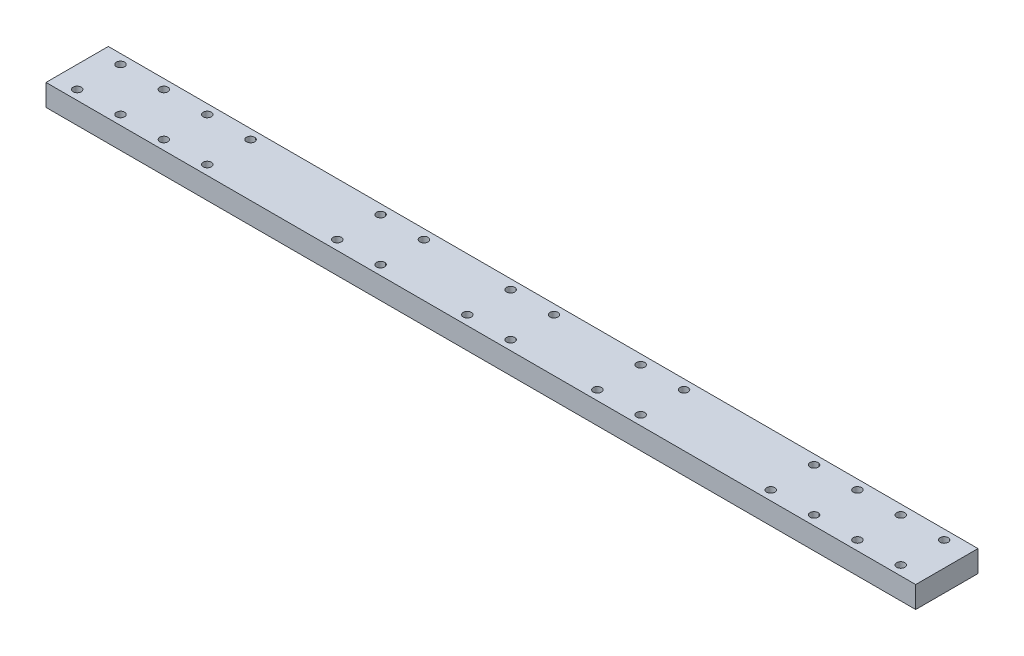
ISO-10303-21;
HEADER;
FILE_DESCRIPTION(('STEP AP214'),'2;1');
FILE_NAME('part.step','',(''),(''),'','','');
FILE_SCHEMA(('AUTOMOTIVE_DESIGN { 1 0 10303 214 1 1 1 1 }'));
ENDSEC;
DATA;
#1=APPLICATION_CONTEXT('core data for automotive mechanical design processes');
#2=APPLICATION_PROTOCOL_DEFINITION('international standard','automotive_design',2000,#1);
#3=PRODUCT_CONTEXT('',#1,'mechanical');
#4=PRODUCT('Part','Part','',(#3));
#5=PRODUCT_RELATED_PRODUCT_CATEGORY('part','',(#4));
#6=PRODUCT_DEFINITION_FORMATION('','',#4);
#7=PRODUCT_DEFINITION_CONTEXT('part definition',#1,'design');
#8=PRODUCT_DEFINITION('design','',#6,#7);
#9=PRODUCT_DEFINITION_SHAPE('','',#8);
#10=(LENGTH_UNIT() NAMED_UNIT(*) SI_UNIT(.MILLI.,.METRE.));
#11=(NAMED_UNIT(*) PLANE_ANGLE_UNIT() SI_UNIT($,.RADIAN.));
#12=(NAMED_UNIT(*) SI_UNIT($,.STERADIAN.) SOLID_ANGLE_UNIT());
#13=UNCERTAINTY_MEASURE_WITH_UNIT(LENGTH_MEASURE(1.E-05),#10,'distance_accuracy_value','');
#14=(GEOMETRIC_REPRESENTATION_CONTEXT(3) GLOBAL_UNCERTAINTY_ASSIGNED_CONTEXT((#13)) GLOBAL_UNIT_ASSIGNED_CONTEXT((#10,
#11,#12)) REPRESENTATION_CONTEXT('',''));
#15=CARTESIAN_POINT('',(0.,0.,0.));
#16=DIRECTION('',(0.,0.,1.));
#17=DIRECTION('',(1.,0.,0.));
#18=AXIS2_PLACEMENT_3D('',#15,#16,#17);
#19=CARTESIAN_POINT('',(0.,8.,0.));
#20=DIRECTION('',(0.,1.,0.));
#21=DIRECTION('',(0.,0.,1.));
#22=AXIS2_PLACEMENT_3D('',#19,#20,#21);
#23=PLANE('',#22);
#24=CARTESIAN_POINT('',(273.704638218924,8.,9.36122448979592));
#25=DIRECTION('',(0.,1.,0.));
#26=DIRECTION('',(0.,0.,1.));
#27=AXIS2_PLACEMENT_3D('',#24,#25,#26);
#28=CIRCLE('',#27,1.50000000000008);
#29=CARTESIAN_POINT('',(273.704638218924,8.,10.861224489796));
#30=VERTEX_POINT('',#29);
#31=EDGE_CURVE('E267',#30,#30,#28,.T.);
#32=ORIENTED_EDGE('',*,*,#31,.F.);
#33=EDGE_LOOP('',(#32));
#34=FACE_BOUND('',#33,.T.);
#35=CARTESIAN_POINT('',(273.704638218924,8.,-6.63877551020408));
#36=DIRECTION('',(0.,1.,0.));
#37=DIRECTION('',(0.,0.,1.));
#38=AXIS2_PLACEMENT_3D('',#35,#36,#37);
#39=CIRCLE('',#38,1.49999999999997);
#40=CARTESIAN_POINT('',(273.704638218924,8.,-5.13877551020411));
#41=VERTEX_POINT('',#40);
#42=EDGE_CURVE('E255',#41,#41,#39,.T.);
#43=ORIENTED_EDGE('',*,*,#42,.F.);
#44=EDGE_LOOP('',(#43));
#45=FACE_BOUND('',#44,.T.);
#46=CARTESIAN_POINT('',(241.704638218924,8.,9.36122448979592));
#47=DIRECTION('',(0.,1.,0.));
#48=DIRECTION('',(0.,0.,1.));
#49=AXIS2_PLACEMENT_3D('',#46,#47,#48);
#50=CIRCLE('',#49,1.50000000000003);
#51=CARTESIAN_POINT('',(241.704638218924,8.,10.8612244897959));
#52=VERTEX_POINT('',#51);
#53=EDGE_CURVE('E243',#52,#52,#50,.T.);
#54=ORIENTED_EDGE('',*,*,#53,.F.);
#55=EDGE_LOOP('',(#54));
#56=FACE_BOUND('',#55,.T.);
#57=CARTESIAN_POINT('',(241.704638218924,8.,-6.63877551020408));
#58=DIRECTION('',(0.,1.,0.));
#59=DIRECTION('',(0.,0.,1.));
#60=AXIS2_PLACEMENT_3D('',#57,#58,#59);
#61=CIRCLE('',#60,1.50000000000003);
#62=CARTESIAN_POINT('',(241.704638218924,8.,-5.13877551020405));
#63=VERTEX_POINT('',#62);
#64=EDGE_CURVE('E231',#63,#63,#61,.T.);
#65=ORIENTED_EDGE('',*,*,#64,.F.);
#66=EDGE_LOOP('',(#65));
#67=FACE_BOUND('',#66,.T.);
#68=CARTESIAN_POINT('',(177.704638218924,8.,9.36122448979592));
#69=DIRECTION('',(0.,1.,0.));
#70=DIRECTION('',(0.,0.,1.));
#71=AXIS2_PLACEMENT_3D('',#68,#69,#70);
#72=CIRCLE('',#71,1.50000000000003);
#73=CARTESIAN_POINT('',(177.704638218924,8.,10.8612244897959));
#74=VERTEX_POINT('',#73);
#75=EDGE_CURVE('E219',#74,#74,#72,.T.);
#76=ORIENTED_EDGE('',*,*,#75,.F.);
#77=EDGE_LOOP('',(#76));
#78=FACE_BOUND('',#77,.T.);
#79=CARTESIAN_POINT('',(177.704638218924,8.,-6.63877551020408));
#80=DIRECTION('',(0.,1.,0.));
#81=DIRECTION('',(0.,0.,1.));
#82=AXIS2_PLACEMENT_3D('',#79,#80,#81);
#83=CIRCLE('',#82,1.50000000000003);
#84=CARTESIAN_POINT('',(177.704638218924,8.,-5.13877551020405));
#85=VERTEX_POINT('',#84);
#86=EDGE_CURVE('E207',#85,#85,#83,.T.);
#87=ORIENTED_EDGE('',*,*,#86,.F.);
#88=EDGE_LOOP('',(#87));
#89=FACE_BOUND('',#88,.T.);
#90=CARTESIAN_POINT('',(129.704638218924,8.,9.36122448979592));
#91=DIRECTION('',(0.,1.,0.));
#92=DIRECTION('',(0.,0.,1.));
#93=AXIS2_PLACEMENT_3D('',#90,#91,#92);
#94=CIRCLE('',#93,1.5);
#95=CARTESIAN_POINT('',(129.704638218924,8.,10.8612244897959));
#96=VERTEX_POINT('',#95);
#97=EDGE_CURVE('E195',#96,#96,#94,.T.);
#98=ORIENTED_EDGE('',*,*,#97,.F.);
#99=EDGE_LOOP('',(#98));
#100=FACE_BOUND('',#99,.T.);
#101=CARTESIAN_POINT('',(129.704638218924,8.,-6.63877551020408));
#102=DIRECTION('',(0.,1.,0.));
#103=DIRECTION('',(0.,0.,1.));
#104=AXIS2_PLACEMENT_3D('',#101,#102,#103);
#105=CIRCLE('',#104,1.5);
#106=CARTESIAN_POINT('',(129.704638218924,8.,-5.13877551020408));
#107=VERTEX_POINT('',#106);
#108=EDGE_CURVE('E183',#107,#107,#105,.T.);
#109=ORIENTED_EDGE('',*,*,#108,.F.);
#110=EDGE_LOOP('',(#109));
#111=FACE_BOUND('',#110,.T.);
#112=CARTESIAN_POINT('',(81.7046382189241,8.,9.36122448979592));
#113=DIRECTION('',(0.,1.,0.));
#114=DIRECTION('',(0.,0.,1.));
#115=AXIS2_PLACEMENT_3D('',#112,#113,#114);
#116=CIRCLE('',#115,1.5);
#117=CARTESIAN_POINT('',(81.7046382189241,8.,10.8612244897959));
#118=VERTEX_POINT('',#117);
#119=EDGE_CURVE('E171',#118,#118,#116,.T.);
#120=ORIENTED_EDGE('',*,*,#119,.F.);
#121=EDGE_LOOP('',(#120));
#122=FACE_BOUND('',#121,.T.);
#123=CARTESIAN_POINT('',(81.7046382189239,8.,-6.63877551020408));
#124=DIRECTION('',(0.,1.,0.));
#125=DIRECTION('',(0.,0.,1.));
#126=AXIS2_PLACEMENT_3D('',#123,#124,#125);
#127=CIRCLE('',#126,1.5);
#128=CARTESIAN_POINT('',(81.7046382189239,8.,-5.13877551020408));
#129=VERTEX_POINT('',#128);
#130=EDGE_CURVE('E159',#129,#129,#127,.T.);
#131=ORIENTED_EDGE('',*,*,#130,.F.);
#132=EDGE_LOOP('',(#131));
#133=FACE_BOUND('',#132,.T.);
#134=CARTESIAN_POINT('',(17.7046382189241,8.,9.36122448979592));
#135=DIRECTION('',(0.,1.,0.));
#136=DIRECTION('',(0.,0.,1.));
#137=AXIS2_PLACEMENT_3D('',#134,#135,#136);
#138=CIRCLE('',#137,1.5);
#139=CARTESIAN_POINT('',(17.7046382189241,8.,10.8612244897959));
#140=VERTEX_POINT('',#139);
#141=EDGE_CURVE('E147',#140,#140,#138,.T.);
#142=ORIENTED_EDGE('',*,*,#141,.F.);
#143=EDGE_LOOP('',(#142));
#144=FACE_BOUND('',#143,.T.);
#145=CARTESIAN_POINT('',(-14.2953617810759,8.,9.36122448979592));
#146=DIRECTION('',(0.,1.,0.));
#147=DIRECTION('',(0.,0.,1.));
#148=AXIS2_PLACEMENT_3D('',#145,#146,#147);
#149=CIRCLE('',#148,1.5);
#150=CARTESIAN_POINT('',(-14.2953617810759,8.,10.8612244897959));
#151=VERTEX_POINT('',#150);
#152=EDGE_CURVE('E135',#151,#151,#149,.T.);
#153=ORIENTED_EDGE('',*,*,#152,.F.);
#154=EDGE_LOOP('',(#153));
#155=FACE_BOUND('',#154,.T.);
#156=CARTESIAN_POINT('',(17.7046382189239,8.,-6.63877551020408));
#157=DIRECTION('',(0.,1.,0.));
#158=DIRECTION('',(0.,0.,1.));
#159=AXIS2_PLACEMENT_3D('',#156,#157,#158);
#160=CIRCLE('',#159,1.5);
#161=CARTESIAN_POINT('',(17.7046382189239,8.,-5.13877551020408));
#162=VERTEX_POINT('',#161);
#163=EDGE_CURVE('E123',#162,#162,#160,.T.);
#164=ORIENTED_EDGE('',*,*,#163,.F.);
#165=EDGE_LOOP('',(#164));
#166=FACE_BOUND('',#165,.T.);
#167=CARTESIAN_POINT('',(-14.2953617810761,8.,-6.63877551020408));
#168=DIRECTION('',(0.,1.,0.));
#169=DIRECTION('',(0.,0.,1.));
#170=AXIS2_PLACEMENT_3D('',#167,#168,#169);
#171=CIRCLE('',#170,1.5);
#172=CARTESIAN_POINT('',(-14.2953617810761,8.,-5.13877551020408));
#173=VERTEX_POINT('',#172);
#174=EDGE_CURVE('E102',#173,#173,#171,.T.);
#175=ORIENTED_EDGE('',*,*,#174,.F.);
#176=EDGE_LOOP('',(#175));
#177=FACE_BOUND('',#176,.T.);
#178=DIRECTION('',(0.,0.,1.));
#179=VECTOR('',#178,1.);
#180=CARTESIAN_POINT('',(-22.2953617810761,8.,-10.1387755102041));
#181=LINE('',#180,#179);
#182=CARTESIAN_POINT('',(-22.2953617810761,8.,-10.1387755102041));
#183=VERTEX_POINT('',#182);
#184=CARTESIAN_POINT('',(-22.2953617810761,8.,12.8612244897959));
#185=VERTEX_POINT('',#184);
#186=EDGE_CURVE('E87',#183,#185,#181,.T.);
#187=ORIENTED_EDGE('',*,*,#186,.T.);
#188=DIRECTION('',(1.,0.,0.));
#189=VECTOR('',#188,1.);
#190=CARTESIAN_POINT('',(-22.2953617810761,8.,12.8612244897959));
#191=LINE('',#190,#189);
#192=CARTESIAN_POINT('',(298.704638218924,8.,12.8612244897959));
#193=VERTEX_POINT('',#192);
#194=EDGE_CURVE('E82',#185,#193,#191,.T.);
#195=ORIENTED_EDGE('',*,*,#194,.T.);
#196=DIRECTION('',(0.,0.,-1.));
#197=VECTOR('',#196,1.);
#198=CARTESIAN_POINT('',(298.704638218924,8.,-10.1387755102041));
#199=LINE('',#198,#197);
#200=CARTESIAN_POINT('',(298.704638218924,8.,-10.1387755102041));
#201=VERTEX_POINT('',#200);
#202=EDGE_CURVE('E85',#193,#201,#199,.T.);
#203=ORIENTED_EDGE('',*,*,#202,.T.);
#204=DIRECTION('',(-1.,0.,0.));
#205=VECTOR('',#204,1.);
#206=CARTESIAN_POINT('',(-22.2953617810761,8.,-10.1387755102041));
#207=LINE('',#206,#205);
#208=EDGE_CURVE('E52',#201,#183,#207,.T.);
#209=ORIENTED_EDGE('',*,*,#208,.T.);
#210=EDGE_LOOP('',(#187,#195,#203,#209));
#211=FACE_BOUND('',#210,.T.);
#212=CARTESIAN_POINT('',(1.70463821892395,8.,-6.63877551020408));
#213=DIRECTION('',(0.,1.,0.));
#214=DIRECTION('',(0.,0.,1.));
#215=AXIS2_PLACEMENT_3D('',#212,#213,#214);
#216=CIRCLE('',#215,1.5);
#217=CARTESIAN_POINT('',(1.70463821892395,8.,-5.13877551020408));
#218=VERTEX_POINT('',#217);
#219=EDGE_CURVE('E117',#218,#218,#216,.T.);
#220=ORIENTED_EDGE('',*,*,#219,.F.);
#221=EDGE_LOOP('',(#220));
#222=FACE_BOUND('',#221,.T.);
#223=CARTESIAN_POINT('',(33.704638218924,8.,-6.63877551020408));
#224=DIRECTION('',(0.,1.,0.));
#225=DIRECTION('',(0.,0.,1.));
#226=AXIS2_PLACEMENT_3D('',#223,#224,#225);
#227=CIRCLE('',#226,1.5);
#228=CARTESIAN_POINT('',(33.704638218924,8.,-5.13877551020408));
#229=VERTEX_POINT('',#228);
#230=EDGE_CURVE('E129',#229,#229,#227,.T.);
#231=ORIENTED_EDGE('',*,*,#230,.F.);
#232=EDGE_LOOP('',(#231));
#233=FACE_BOUND('',#232,.T.);
#234=CARTESIAN_POINT('',(1.70463821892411,8.,9.36122448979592));
#235=DIRECTION('',(0.,1.,0.));
#236=DIRECTION('',(0.,0.,1.));
#237=AXIS2_PLACEMENT_3D('',#234,#235,#236);
#238=CIRCLE('',#237,1.5);
#239=CARTESIAN_POINT('',(1.70463821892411,8.,10.8612244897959));
#240=VERTEX_POINT('',#239);
#241=EDGE_CURVE('E141',#240,#240,#238,.T.);
#242=ORIENTED_EDGE('',*,*,#241,.F.);
#243=EDGE_LOOP('',(#242));
#244=FACE_BOUND('',#243,.T.);
#245=CARTESIAN_POINT('',(33.7046382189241,8.,9.36122448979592));
#246=DIRECTION('',(0.,1.,0.));
#247=DIRECTION('',(0.,0.,1.));
#248=AXIS2_PLACEMENT_3D('',#245,#246,#247);
#249=CIRCLE('',#248,1.5);
#250=CARTESIAN_POINT('',(33.7046382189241,8.,10.8612244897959));
#251=VERTEX_POINT('',#250);
#252=EDGE_CURVE('E153',#251,#251,#249,.T.);
#253=ORIENTED_EDGE('',*,*,#252,.F.);
#254=EDGE_LOOP('',(#253));
#255=FACE_BOUND('',#254,.T.);
#256=CARTESIAN_POINT('',(97.7046382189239,8.,-6.63877551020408));
#257=DIRECTION('',(0.,1.,0.));
#258=DIRECTION('',(0.,0.,1.));
#259=AXIS2_PLACEMENT_3D('',#256,#257,#258);
#260=CIRCLE('',#259,1.5);
#261=CARTESIAN_POINT('',(97.7046382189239,8.,-5.13877551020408));
#262=VERTEX_POINT('',#261);
#263=EDGE_CURVE('E165',#262,#262,#260,.T.);
#264=ORIENTED_EDGE('',*,*,#263,.F.);
#265=EDGE_LOOP('',(#264));
#266=FACE_BOUND('',#265,.T.);
#267=CARTESIAN_POINT('',(97.7046382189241,8.,9.36122448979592));
#268=DIRECTION('',(0.,1.,0.));
#269=DIRECTION('',(0.,0.,1.));
#270=AXIS2_PLACEMENT_3D('',#267,#268,#269);
#271=CIRCLE('',#270,1.5);
#272=CARTESIAN_POINT('',(97.7046382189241,8.,10.8612244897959));
#273=VERTEX_POINT('',#272);
#274=EDGE_CURVE('E177',#273,#273,#271,.T.);
#275=ORIENTED_EDGE('',*,*,#274,.F.);
#276=EDGE_LOOP('',(#275));
#277=FACE_BOUND('',#276,.T.);
#278=CARTESIAN_POINT('',(145.704638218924,8.,-6.63877551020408));
#279=DIRECTION('',(0.,1.,0.));
#280=DIRECTION('',(0.,0.,1.));
#281=AXIS2_PLACEMENT_3D('',#278,#279,#280);
#282=CIRCLE('',#281,1.49999999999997);
#283=CARTESIAN_POINT('',(145.704638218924,8.,-5.13877551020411));
#284=VERTEX_POINT('',#283);
#285=EDGE_CURVE('E189',#284,#284,#282,.T.);
#286=ORIENTED_EDGE('',*,*,#285,.F.);
#287=EDGE_LOOP('',(#286));
#288=FACE_BOUND('',#287,.T.);
#289=CARTESIAN_POINT('',(145.704638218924,8.,9.36122448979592));
#290=DIRECTION('',(0.,1.,0.));
#291=DIRECTION('',(0.,0.,1.));
#292=AXIS2_PLACEMENT_3D('',#289,#290,#291);
#293=CIRCLE('',#292,1.49999999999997);
#294=CARTESIAN_POINT('',(145.704638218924,8.,10.8612244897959));
#295=VERTEX_POINT('',#294);
#296=EDGE_CURVE('E201',#295,#295,#293,.T.);
#297=ORIENTED_EDGE('',*,*,#296,.F.);
#298=EDGE_LOOP('',(#297));
#299=FACE_BOUND('',#298,.T.);
#300=CARTESIAN_POINT('',(193.704638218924,8.,-6.63877551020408));
#301=DIRECTION('',(0.,1.,0.));
#302=DIRECTION('',(0.,0.,1.));
#303=AXIS2_PLACEMENT_3D('',#300,#301,#302);
#304=CIRCLE('',#303,1.49999999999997);
#305=CARTESIAN_POINT('',(193.704638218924,8.,-5.13877551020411));
#306=VERTEX_POINT('',#305);
#307=EDGE_CURVE('E213',#306,#306,#304,.T.);
#308=ORIENTED_EDGE('',*,*,#307,.F.);
#309=EDGE_LOOP('',(#308));
#310=FACE_BOUND('',#309,.T.);
#311=CARTESIAN_POINT('',(193.704638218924,8.,9.36122448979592));
#312=DIRECTION('',(0.,1.,0.));
#313=DIRECTION('',(0.,0.,1.));
#314=AXIS2_PLACEMENT_3D('',#311,#312,#313);
#315=CIRCLE('',#314,1.49999999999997);
#316=CARTESIAN_POINT('',(193.704638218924,8.,10.8612244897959));
#317=VERTEX_POINT('',#316);
#318=EDGE_CURVE('E225',#317,#317,#315,.T.);
#319=ORIENTED_EDGE('',*,*,#318,.F.);
#320=EDGE_LOOP('',(#319));
#321=FACE_BOUND('',#320,.T.);
#322=CARTESIAN_POINT('',(257.704638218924,8.,-6.63877551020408));
#323=DIRECTION('',(0.,1.,0.));
#324=DIRECTION('',(0.,0.,1.));
#325=AXIS2_PLACEMENT_3D('',#322,#323,#324);
#326=CIRCLE('',#325,1.49999999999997);
#327=CARTESIAN_POINT('',(257.704638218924,8.,-5.13877551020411));
#328=VERTEX_POINT('',#327);
#329=EDGE_CURVE('E237',#328,#328,#326,.T.);
#330=ORIENTED_EDGE('',*,*,#329,.F.);
#331=EDGE_LOOP('',(#330));
#332=FACE_BOUND('',#331,.T.);
#333=CARTESIAN_POINT('',(257.704638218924,8.,9.36122448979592));
#334=DIRECTION('',(0.,1.,0.));
#335=DIRECTION('',(0.,0.,1.));
#336=AXIS2_PLACEMENT_3D('',#333,#334,#335);
#337=CIRCLE('',#336,1.49999999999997);
#338=CARTESIAN_POINT('',(257.704638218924,8.,10.8612244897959));
#339=VERTEX_POINT('',#338);
#340=EDGE_CURVE('E249',#339,#339,#337,.T.);
#341=ORIENTED_EDGE('',*,*,#340,.F.);
#342=EDGE_LOOP('',(#341));
#343=FACE_BOUND('',#342,.T.);
#344=CARTESIAN_POINT('',(289.704638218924,8.,-6.63877551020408));
#345=DIRECTION('',(0.,1.,0.));
#346=DIRECTION('',(0.,0.,1.));
#347=AXIS2_PLACEMENT_3D('',#344,#345,#346);
#348=CIRCLE('',#347,1.49999999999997);
#349=CARTESIAN_POINT('',(289.704638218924,8.,-5.13877551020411));
#350=VERTEX_POINT('',#349);
#351=EDGE_CURVE('E261',#350,#350,#348,.T.);
#352=ORIENTED_EDGE('',*,*,#351,.F.);
#353=EDGE_LOOP('',(#352));
#354=FACE_BOUND('',#353,.T.);
#355=CARTESIAN_POINT('',(289.704638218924,8.,9.36122448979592));
#356=DIRECTION('',(0.,1.,0.));
#357=DIRECTION('',(0.,0.,1.));
#358=AXIS2_PLACEMENT_3D('',#355,#356,#357);
#359=CIRCLE('',#358,1.49999999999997);
#360=CARTESIAN_POINT('',(289.704638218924,8.,10.8612244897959));
#361=VERTEX_POINT('',#360);
#362=EDGE_CURVE('E273',#361,#361,#359,.T.);
#363=ORIENTED_EDGE('',*,*,#362,.F.);
#364=EDGE_LOOP('',(#363));
#365=FACE_BOUND('',#364,.T.);
#366=ADVANCED_FACE('F35',(#34,#45,#56,#67,#78,#89,#100,#111,#122,#133,#144,#155,#166,#177,#211,
#222,#233,#244,#255,#266,#277,#288,#299,#310,#321,#332,#343,#354,#365),#23,.T.);
#367=CARTESIAN_POINT('',(0.,0.,0.));
#368=DIRECTION('',(0.,1.,0.));
#369=DIRECTION('',(0.,0.,1.));
#370=AXIS2_PLACEMENT_3D('',#367,#368,#369);
#371=PLANE('',#370);
#372=DIRECTION('',(0.,0.,1.));
#373=VECTOR('',#372,1.);
#374=CARTESIAN_POINT('',(-22.2953617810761,0.,-10.1387755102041));
#375=LINE('',#374,#373);
#376=CARTESIAN_POINT('',(-22.2953617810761,0.,-10.1387755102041));
#377=VERTEX_POINT('',#376);
#378=CARTESIAN_POINT('',(-22.2953617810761,0.,12.8612244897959));
#379=VERTEX_POINT('',#378);
#380=EDGE_CURVE('E99',#377,#379,#375,.T.);
#381=ORIENTED_EDGE('',*,*,#380,.F.);
#382=DIRECTION('',(-1.,0.,0.));
#383=VECTOR('',#382,1.);
#384=CARTESIAN_POINT('',(-22.2953617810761,0.,-10.1387755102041));
#385=LINE('',#384,#383);
#386=CARTESIAN_POINT('',(298.704638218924,0.,-10.1387755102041));
#387=VERTEX_POINT('',#386);
#388=EDGE_CURVE('E75',#387,#377,#385,.T.);
#389=ORIENTED_EDGE('',*,*,#388,.F.);
#390=DIRECTION('',(0.,0.,-1.));
#391=VECTOR('',#390,1.);
#392=CARTESIAN_POINT('',(298.704638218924,0.,-10.1387755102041));
#393=LINE('',#392,#391);
#394=CARTESIAN_POINT('',(298.704638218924,0.,12.8612244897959));
#395=VERTEX_POINT('',#394);
#396=EDGE_CURVE('E69',#395,#387,#393,.T.);
#397=ORIENTED_EDGE('',*,*,#396,.F.);
#398=DIRECTION('',(1.,0.,0.));
#399=VECTOR('',#398,1.);
#400=CARTESIAN_POINT('',(-22.2953617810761,0.,12.8612244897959));
#401=LINE('',#400,#399);
#402=EDGE_CURVE('E91',#379,#395,#401,.T.);
#403=ORIENTED_EDGE('',*,*,#402,.F.);
#404=EDGE_LOOP('',(#381,#389,#397,#403));
#405=FACE_BOUND('',#404,.T.);
#406=CARTESIAN_POINT('',(-14.2953617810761,0.,-6.63877551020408));
#407=DIRECTION('',(0.,1.,0.));
#408=DIRECTION('',(0.,0.,1.));
#409=AXIS2_PLACEMENT_3D('',#406,#407,#408);
#410=CIRCLE('',#409,1.5);
#411=CARTESIAN_POINT('',(-14.2953617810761,0.,-5.13877551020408));
#412=VERTEX_POINT('',#411);
#413=EDGE_CURVE('E114',#412,#412,#410,.T.);
#414=ORIENTED_EDGE('',*,*,#413,.T.);
#415=EDGE_LOOP('',(#414));
#416=FACE_BOUND('',#415,.T.);
#417=CARTESIAN_POINT('',(1.70463821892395,0.,-6.63877551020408));
#418=DIRECTION('',(0.,1.,0.));
#419=DIRECTION('',(0.,0.,1.));
#420=AXIS2_PLACEMENT_3D('',#417,#418,#419);
#421=CIRCLE('',#420,1.5);
#422=CARTESIAN_POINT('',(1.70463821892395,0.,-5.13877551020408));
#423=VERTEX_POINT('',#422);
#424=EDGE_CURVE('E120',#423,#423,#421,.T.);
#425=ORIENTED_EDGE('',*,*,#424,.T.);
#426=EDGE_LOOP('',(#425));
#427=FACE_BOUND('',#426,.T.);
#428=CARTESIAN_POINT('',(17.7046382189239,0.,-6.63877551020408));
#429=DIRECTION('',(0.,1.,0.));
#430=DIRECTION('',(0.,0.,1.));
#431=AXIS2_PLACEMENT_3D('',#428,#429,#430);
#432=CIRCLE('',#431,1.5);
#433=CARTESIAN_POINT('',(17.7046382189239,0.,-5.13877551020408));
#434=VERTEX_POINT('',#433);
#435=EDGE_CURVE('E126',#434,#434,#432,.T.);
#436=ORIENTED_EDGE('',*,*,#435,.T.);
#437=EDGE_LOOP('',(#436));
#438=FACE_BOUND('',#437,.T.);
#439=CARTESIAN_POINT('',(33.704638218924,0.,-6.63877551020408));
#440=DIRECTION('',(0.,1.,0.));
#441=DIRECTION('',(0.,0.,1.));
#442=AXIS2_PLACEMENT_3D('',#439,#440,#441);
#443=CIRCLE('',#442,1.5);
#444=CARTESIAN_POINT('',(33.704638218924,0.,-5.13877551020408));
#445=VERTEX_POINT('',#444);
#446=EDGE_CURVE('E132',#445,#445,#443,.T.);
#447=ORIENTED_EDGE('',*,*,#446,.T.);
#448=EDGE_LOOP('',(#447));
#449=FACE_BOUND('',#448,.T.);
#450=CARTESIAN_POINT('',(-14.2953617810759,0.,9.36122448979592));
#451=DIRECTION('',(0.,1.,0.));
#452=DIRECTION('',(0.,0.,1.));
#453=AXIS2_PLACEMENT_3D('',#450,#451,#452);
#454=CIRCLE('',#453,1.5);
#455=CARTESIAN_POINT('',(-14.2953617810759,0.,10.8612244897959));
#456=VERTEX_POINT('',#455);
#457=EDGE_CURVE('E138',#456,#456,#454,.T.);
#458=ORIENTED_EDGE('',*,*,#457,.T.);
#459=EDGE_LOOP('',(#458));
#460=FACE_BOUND('',#459,.T.);
#461=CARTESIAN_POINT('',(1.70463821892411,0.,9.36122448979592));
#462=DIRECTION('',(0.,1.,0.));
#463=DIRECTION('',(0.,0.,1.));
#464=AXIS2_PLACEMENT_3D('',#461,#462,#463);
#465=CIRCLE('',#464,1.5);
#466=CARTESIAN_POINT('',(1.70463821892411,0.,10.8612244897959));
#467=VERTEX_POINT('',#466);
#468=EDGE_CURVE('E144',#467,#467,#465,.T.);
#469=ORIENTED_EDGE('',*,*,#468,.T.);
#470=EDGE_LOOP('',(#469));
#471=FACE_BOUND('',#470,.T.);
#472=CARTESIAN_POINT('',(17.7046382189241,0.,9.36122448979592));
#473=DIRECTION('',(0.,1.,0.));
#474=DIRECTION('',(0.,0.,1.));
#475=AXIS2_PLACEMENT_3D('',#472,#473,#474);
#476=CIRCLE('',#475,1.5);
#477=CARTESIAN_POINT('',(17.7046382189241,0.,10.8612244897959));
#478=VERTEX_POINT('',#477);
#479=EDGE_CURVE('E150',#478,#478,#476,.T.);
#480=ORIENTED_EDGE('',*,*,#479,.T.);
#481=EDGE_LOOP('',(#480));
#482=FACE_BOUND('',#481,.T.);
#483=CARTESIAN_POINT('',(33.7046382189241,0.,9.36122448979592));
#484=DIRECTION('',(0.,1.,0.));
#485=DIRECTION('',(0.,0.,1.));
#486=AXIS2_PLACEMENT_3D('',#483,#484,#485);
#487=CIRCLE('',#486,1.5);
#488=CARTESIAN_POINT('',(33.7046382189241,0.,10.8612244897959));
#489=VERTEX_POINT('',#488);
#490=EDGE_CURVE('E156',#489,#489,#487,.T.);
#491=ORIENTED_EDGE('',*,*,#490,.T.);
#492=EDGE_LOOP('',(#491));
#493=FACE_BOUND('',#492,.T.);
#494=CARTESIAN_POINT('',(81.7046382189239,0.,-6.63877551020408));
#495=DIRECTION('',(0.,1.,0.));
#496=DIRECTION('',(0.,0.,1.));
#497=AXIS2_PLACEMENT_3D('',#494,#495,#496);
#498=CIRCLE('',#497,1.5);
#499=CARTESIAN_POINT('',(81.7046382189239,0.,-5.13877551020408));
#500=VERTEX_POINT('',#499);
#501=EDGE_CURVE('E162',#500,#500,#498,.T.);
#502=ORIENTED_EDGE('',*,*,#501,.T.);
#503=EDGE_LOOP('',(#502));
#504=FACE_BOUND('',#503,.T.);
#505=CARTESIAN_POINT('',(97.7046382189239,0.,-6.63877551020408));
#506=DIRECTION('',(0.,1.,0.));
#507=DIRECTION('',(0.,0.,1.));
#508=AXIS2_PLACEMENT_3D('',#505,#506,#507);
#509=CIRCLE('',#508,1.5);
#510=CARTESIAN_POINT('',(97.7046382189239,0.,-5.13877551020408));
#511=VERTEX_POINT('',#510);
#512=EDGE_CURVE('E168',#511,#511,#509,.T.);
#513=ORIENTED_EDGE('',*,*,#512,.T.);
#514=EDGE_LOOP('',(#513));
#515=FACE_BOUND('',#514,.T.);
#516=CARTESIAN_POINT('',(81.7046382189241,0.,9.36122448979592));
#517=DIRECTION('',(0.,1.,0.));
#518=DIRECTION('',(0.,0.,1.));
#519=AXIS2_PLACEMENT_3D('',#516,#517,#518);
#520=CIRCLE('',#519,1.5);
#521=CARTESIAN_POINT('',(81.7046382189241,0.,10.8612244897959));
#522=VERTEX_POINT('',#521);
#523=EDGE_CURVE('E174',#522,#522,#520,.T.);
#524=ORIENTED_EDGE('',*,*,#523,.T.);
#525=EDGE_LOOP('',(#524));
#526=FACE_BOUND('',#525,.T.);
#527=CARTESIAN_POINT('',(97.7046382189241,0.,9.36122448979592));
#528=DIRECTION('',(0.,1.,0.));
#529=DIRECTION('',(0.,0.,1.));
#530=AXIS2_PLACEMENT_3D('',#527,#528,#529);
#531=CIRCLE('',#530,1.5);
#532=CARTESIAN_POINT('',(97.7046382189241,0.,10.8612244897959));
#533=VERTEX_POINT('',#532);
#534=EDGE_CURVE('E180',#533,#533,#531,.T.);
#535=ORIENTED_EDGE('',*,*,#534,.T.);
#536=EDGE_LOOP('',(#535));
#537=FACE_BOUND('',#536,.T.);
#538=CARTESIAN_POINT('',(129.704638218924,0.,-6.63877551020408));
#539=DIRECTION('',(0.,1.,0.));
#540=DIRECTION('',(0.,0.,1.));
#541=AXIS2_PLACEMENT_3D('',#538,#539,#540);
#542=CIRCLE('',#541,1.5);
#543=CARTESIAN_POINT('',(129.704638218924,0.,-5.13877551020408));
#544=VERTEX_POINT('',#543);
#545=EDGE_CURVE('E186',#544,#544,#542,.T.);
#546=ORIENTED_EDGE('',*,*,#545,.T.);
#547=EDGE_LOOP('',(#546));
#548=FACE_BOUND('',#547,.T.);
#549=CARTESIAN_POINT('',(145.704638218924,0.,-6.63877551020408));
#550=DIRECTION('',(0.,1.,0.));
#551=DIRECTION('',(0.,0.,1.));
#552=AXIS2_PLACEMENT_3D('',#549,#550,#551);
#553=CIRCLE('',#552,1.49999999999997);
#554=CARTESIAN_POINT('',(145.704638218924,0.,-5.13877551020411));
#555=VERTEX_POINT('',#554);
#556=EDGE_CURVE('E192',#555,#555,#553,.T.);
#557=ORIENTED_EDGE('',*,*,#556,.T.);
#558=EDGE_LOOP('',(#557));
#559=FACE_BOUND('',#558,.T.);
#560=CARTESIAN_POINT('',(129.704638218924,0.,9.36122448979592));
#561=DIRECTION('',(0.,1.,0.));
#562=DIRECTION('',(0.,0.,1.));
#563=AXIS2_PLACEMENT_3D('',#560,#561,#562);
#564=CIRCLE('',#563,1.5);
#565=CARTESIAN_POINT('',(129.704638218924,0.,10.8612244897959));
#566=VERTEX_POINT('',#565);
#567=EDGE_CURVE('E198',#566,#566,#564,.T.);
#568=ORIENTED_EDGE('',*,*,#567,.T.);
#569=EDGE_LOOP('',(#568));
#570=FACE_BOUND('',#569,.T.);
#571=CARTESIAN_POINT('',(145.704638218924,0.,9.36122448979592));
#572=DIRECTION('',(0.,1.,0.));
#573=DIRECTION('',(0.,0.,1.));
#574=AXIS2_PLACEMENT_3D('',#571,#572,#573);
#575=CIRCLE('',#574,1.49999999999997);
#576=CARTESIAN_POINT('',(145.704638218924,0.,10.8612244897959));
#577=VERTEX_POINT('',#576);
#578=EDGE_CURVE('E204',#577,#577,#575,.T.);
#579=ORIENTED_EDGE('',*,*,#578,.T.);
#580=EDGE_LOOP('',(#579));
#581=FACE_BOUND('',#580,.T.);
#582=CARTESIAN_POINT('',(177.704638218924,0.,-6.63877551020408));
#583=DIRECTION('',(0.,1.,0.));
#584=DIRECTION('',(0.,0.,1.));
#585=AXIS2_PLACEMENT_3D('',#582,#583,#584);
#586=CIRCLE('',#585,1.50000000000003);
#587=CARTESIAN_POINT('',(177.704638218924,0.,-5.13877551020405));
#588=VERTEX_POINT('',#587);
#589=EDGE_CURVE('E210',#588,#588,#586,.T.);
#590=ORIENTED_EDGE('',*,*,#589,.T.);
#591=EDGE_LOOP('',(#590));
#592=FACE_BOUND('',#591,.T.);
#593=CARTESIAN_POINT('',(193.704638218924,0.,-6.63877551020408));
#594=DIRECTION('',(0.,1.,0.));
#595=DIRECTION('',(0.,0.,1.));
#596=AXIS2_PLACEMENT_3D('',#593,#594,#595);
#597=CIRCLE('',#596,1.49999999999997);
#598=CARTESIAN_POINT('',(193.704638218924,0.,-5.13877551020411));
#599=VERTEX_POINT('',#598);
#600=EDGE_CURVE('E216',#599,#599,#597,.T.);
#601=ORIENTED_EDGE('',*,*,#600,.T.);
#602=EDGE_LOOP('',(#601));
#603=FACE_BOUND('',#602,.T.);
#604=CARTESIAN_POINT('',(177.704638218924,0.,9.36122448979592));
#605=DIRECTION('',(0.,1.,0.));
#606=DIRECTION('',(0.,0.,1.));
#607=AXIS2_PLACEMENT_3D('',#604,#605,#606);
#608=CIRCLE('',#607,1.50000000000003);
#609=CARTESIAN_POINT('',(177.704638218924,0.,10.8612244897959));
#610=VERTEX_POINT('',#609);
#611=EDGE_CURVE('E222',#610,#610,#608,.T.);
#612=ORIENTED_EDGE('',*,*,#611,.T.);
#613=EDGE_LOOP('',(#612));
#614=FACE_BOUND('',#613,.T.);
#615=CARTESIAN_POINT('',(193.704638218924,0.,9.36122448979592));
#616=DIRECTION('',(0.,1.,0.));
#617=DIRECTION('',(0.,0.,1.));
#618=AXIS2_PLACEMENT_3D('',#615,#616,#617);
#619=CIRCLE('',#618,1.49999999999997);
#620=CARTESIAN_POINT('',(193.704638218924,0.,10.8612244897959));
#621=VERTEX_POINT('',#620);
#622=EDGE_CURVE('E228',#621,#621,#619,.T.);
#623=ORIENTED_EDGE('',*,*,#622,.T.);
#624=EDGE_LOOP('',(#623));
#625=FACE_BOUND('',#624,.T.);
#626=CARTESIAN_POINT('',(241.704638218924,0.,-6.63877551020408));
#627=DIRECTION('',(0.,1.,0.));
#628=DIRECTION('',(0.,0.,1.));
#629=AXIS2_PLACEMENT_3D('',#626,#627,#628);
#630=CIRCLE('',#629,1.50000000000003);
#631=CARTESIAN_POINT('',(241.704638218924,0.,-5.13877551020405));
#632=VERTEX_POINT('',#631);
#633=EDGE_CURVE('E234',#632,#632,#630,.T.);
#634=ORIENTED_EDGE('',*,*,#633,.T.);
#635=EDGE_LOOP('',(#634));
#636=FACE_BOUND('',#635,.T.);
#637=CARTESIAN_POINT('',(257.704638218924,0.,-6.63877551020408));
#638=DIRECTION('',(0.,1.,0.));
#639=DIRECTION('',(0.,0.,1.));
#640=AXIS2_PLACEMENT_3D('',#637,#638,#639);
#641=CIRCLE('',#640,1.49999999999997);
#642=CARTESIAN_POINT('',(257.704638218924,0.,-5.13877551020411));
#643=VERTEX_POINT('',#642);
#644=EDGE_CURVE('E240',#643,#643,#641,.T.);
#645=ORIENTED_EDGE('',*,*,#644,.T.);
#646=EDGE_LOOP('',(#645));
#647=FACE_BOUND('',#646,.T.);
#648=CARTESIAN_POINT('',(241.704638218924,0.,9.36122448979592));
#649=DIRECTION('',(0.,1.,0.));
#650=DIRECTION('',(0.,0.,1.));
#651=AXIS2_PLACEMENT_3D('',#648,#649,#650);
#652=CIRCLE('',#651,1.50000000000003);
#653=CARTESIAN_POINT('',(241.704638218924,0.,10.8612244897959));
#654=VERTEX_POINT('',#653);
#655=EDGE_CURVE('E246',#654,#654,#652,.T.);
#656=ORIENTED_EDGE('',*,*,#655,.T.);
#657=EDGE_LOOP('',(#656));
#658=FACE_BOUND('',#657,.T.);
#659=CARTESIAN_POINT('',(257.704638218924,0.,9.36122448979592));
#660=DIRECTION('',(0.,1.,0.));
#661=DIRECTION('',(0.,0.,1.));
#662=AXIS2_PLACEMENT_3D('',#659,#660,#661);
#663=CIRCLE('',#662,1.49999999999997);
#664=CARTESIAN_POINT('',(257.704638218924,0.,10.8612244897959));
#665=VERTEX_POINT('',#664);
#666=EDGE_CURVE('E252',#665,#665,#663,.T.);
#667=ORIENTED_EDGE('',*,*,#666,.T.);
#668=EDGE_LOOP('',(#667));
#669=FACE_BOUND('',#668,.T.);
#670=CARTESIAN_POINT('',(273.704638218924,0.,-6.63877551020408));
#671=DIRECTION('',(0.,1.,0.));
#672=DIRECTION('',(0.,0.,1.));
#673=AXIS2_PLACEMENT_3D('',#670,#671,#672);
#674=CIRCLE('',#673,1.49999999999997);
#675=CARTESIAN_POINT('',(273.704638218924,0.,-5.13877551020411));
#676=VERTEX_POINT('',#675);
#677=EDGE_CURVE('E258',#676,#676,#674,.T.);
#678=ORIENTED_EDGE('',*,*,#677,.T.);
#679=EDGE_LOOP('',(#678));
#680=FACE_BOUND('',#679,.T.);
#681=CARTESIAN_POINT('',(289.704638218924,0.,-6.63877551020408));
#682=DIRECTION('',(0.,1.,0.));
#683=DIRECTION('',(0.,0.,1.));
#684=AXIS2_PLACEMENT_3D('',#681,#682,#683);
#685=CIRCLE('',#684,1.49999999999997);
#686=CARTESIAN_POINT('',(289.704638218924,0.,-5.13877551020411));
#687=VERTEX_POINT('',#686);
#688=EDGE_CURVE('E264',#687,#687,#685,.T.);
#689=ORIENTED_EDGE('',*,*,#688,.T.);
#690=EDGE_LOOP('',(#689));
#691=FACE_BOUND('',#690,.T.);
#692=CARTESIAN_POINT('',(273.704638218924,0.,9.36122448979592));
#693=DIRECTION('',(0.,1.,0.));
#694=DIRECTION('',(0.,0.,1.));
#695=AXIS2_PLACEMENT_3D('',#692,#693,#694);
#696=CIRCLE('',#695,1.50000000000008);
#697=CARTESIAN_POINT('',(273.704638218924,0.,10.861224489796));
#698=VERTEX_POINT('',#697);
#699=EDGE_CURVE('E270',#698,#698,#696,.T.);
#700=ORIENTED_EDGE('',*,*,#699,.T.);
#701=EDGE_LOOP('',(#700));
#702=FACE_BOUND('',#701,.T.);
#703=CARTESIAN_POINT('',(289.704638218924,0.,9.36122448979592));
#704=DIRECTION('',(0.,1.,0.));
#705=DIRECTION('',(0.,0.,1.));
#706=AXIS2_PLACEMENT_3D('',#703,#704,#705);
#707=CIRCLE('',#706,1.49999999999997);
#708=CARTESIAN_POINT('',(289.704638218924,0.,10.8612244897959));
#709=VERTEX_POINT('',#708);
#710=EDGE_CURVE('E276',#709,#709,#707,.T.);
#711=ORIENTED_EDGE('',*,*,#710,.T.);
#712=EDGE_LOOP('',(#711));
#713=FACE_BOUND('',#712,.T.);
#714=ADVANCED_FACE('F110',(#405,#416,#427,#438,#449,#460,#471,#482,#493,#504,#515,#526,#537,
#548,#559,#570,#581,#592,#603,#614,#625,#636,#647,#658,#669,#680,#691,#702,#713),#371,.F.);
#715=CARTESIAN_POINT('',(-22.2953617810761,8.,-10.1387755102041));
#716=DIRECTION('',(1.,0.,0.));
#717=DIRECTION('',(0.,0.,-1.));
#718=AXIS2_PLACEMENT_3D('',#715,#716,#717);
#719=PLANE('',#718);
#720=ORIENTED_EDGE('',*,*,#380,.T.);
#721=DIRECTION('',(0.,-1.,0.));
#722=VECTOR('',#721,1.);
#723=CARTESIAN_POINT('',(-22.2953617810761,8.,12.8612244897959));
#724=LINE('',#723,#722);
#725=EDGE_CURVE('E11',#185,#379,#724,.T.);
#726=ORIENTED_EDGE('',*,*,#725,.F.);
#727=ORIENTED_EDGE('',*,*,#186,.F.);
#728=DIRECTION('',(0.,-1.,0.));
#729=VECTOR('',#728,1.);
#730=CARTESIAN_POINT('',(-22.2953617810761,8.,-10.1387755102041));
#731=LINE('',#730,#729);
#732=EDGE_CURVE('E95',#183,#377,#731,.T.);
#733=ORIENTED_EDGE('',*,*,#732,.T.);
#734=EDGE_LOOP('',(#720,#726,#727,#733));
#735=FACE_BOUND('',#734,.T.);
#736=ADVANCED_FACE('F37',(#735),#719,.F.);
#737=CARTESIAN_POINT('',(-22.2953617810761,8.,12.8612244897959));
#738=DIRECTION('',(0.,0.,-1.));
#739=DIRECTION('',(-1.,0.,0.));
#740=AXIS2_PLACEMENT_3D('',#737,#738,#739);
#741=PLANE('',#740);
#742=ORIENTED_EDGE('',*,*,#402,.T.);
#743=DIRECTION('',(0.,-1.,0.));
#744=VECTOR('',#743,1.);
#745=CARTESIAN_POINT('',(298.704638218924,8.,12.8612244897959));
#746=LINE('',#745,#744);
#747=EDGE_CURVE('E44',#193,#395,#746,.T.);
#748=ORIENTED_EDGE('',*,*,#747,.F.);
#749=ORIENTED_EDGE('',*,*,#194,.F.);
#750=ORIENTED_EDGE('',*,*,#725,.T.);
#751=EDGE_LOOP('',(#742,#748,#749,#750));
#752=FACE_BOUND('',#751,.T.);
#753=ADVANCED_FACE('F90',(#752),#741,.F.);
#754=CARTESIAN_POINT('',(298.704638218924,8.,-10.1387755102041));
#755=DIRECTION('',(-1.,0.,0.));
#756=DIRECTION('',(0.,0.,1.));
#757=AXIS2_PLACEMENT_3D('',#754,#755,#756);
#758=PLANE('',#757);
#759=ORIENTED_EDGE('',*,*,#396,.T.);
#760=DIRECTION('',(0.,-1.,0.));
#761=VECTOR('',#760,1.);
#762=CARTESIAN_POINT('',(298.704638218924,8.,-10.1387755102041));
#763=LINE('',#762,#761);
#764=EDGE_CURVE('E92',#201,#387,#763,.T.);
#765=ORIENTED_EDGE('',*,*,#764,.F.);
#766=ORIENTED_EDGE('',*,*,#202,.F.);
#767=ORIENTED_EDGE('',*,*,#747,.T.);
#768=EDGE_LOOP('',(#759,#765,#766,#767));
#769=FACE_BOUND('',#768,.T.);
#770=ADVANCED_FACE('F93',(#769),#758,.F.);
#771=CARTESIAN_POINT('',(-22.2953617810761,8.,-10.1387755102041));
#772=DIRECTION('',(0.,0.,1.));
#773=DIRECTION('',(1.,0.,0.));
#774=AXIS2_PLACEMENT_3D('',#771,#772,#773);
#775=PLANE('',#774);
#776=ORIENTED_EDGE('',*,*,#388,.T.);
#777=ORIENTED_EDGE('',*,*,#732,.F.);
#778=ORIENTED_EDGE('',*,*,#208,.F.);
#779=ORIENTED_EDGE('',*,*,#764,.T.);
#780=EDGE_LOOP('',(#776,#777,#778,#779));
#781=FACE_BOUND('',#780,.T.);
#782=ADVANCED_FACE('F107',(#781),#775,.F.);
#783=CARTESIAN_POINT('',(-14.2953617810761,8.,-6.63877551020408));
#784=DIRECTION('',(0.,-1.,0.));
#785=DIRECTION('',(0.,0.,-1.));
#786=AXIS2_PLACEMENT_3D('',#783,#784,#785);
#787=CYLINDRICAL_SURFACE('',#786,1.5);
#788=ORIENTED_EDGE('',*,*,#174,.T.);
#789=EDGE_LOOP('',(#788));
#790=FACE_BOUND('',#789,.T.);
#791=ORIENTED_EDGE('',*,*,#413,.F.);
#792=EDGE_LOOP('',(#791));
#793=FACE_BOUND('',#792,.T.);
#794=ADVANCED_FACE('F295',(#790,#793),#787,.F.);
#795=CARTESIAN_POINT('',(1.70463821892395,8.,-6.63877551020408));
#796=DIRECTION('',(0.,-1.,0.));
#797=DIRECTION('',(0.,0.,-1.));
#798=AXIS2_PLACEMENT_3D('',#795,#796,#797);
#799=CYLINDRICAL_SURFACE('',#798,1.5);
#800=ORIENTED_EDGE('',*,*,#219,.T.);
#801=EDGE_LOOP('',(#800));
#802=FACE_BOUND('',#801,.T.);
#803=ORIENTED_EDGE('',*,*,#424,.F.);
#804=EDGE_LOOP('',(#803));
#805=FACE_BOUND('',#804,.T.);
#806=ADVANCED_FACE('F341',(#802,#805),#799,.F.);
#807=CARTESIAN_POINT('',(17.7046382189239,8.,-6.63877551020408));
#808=DIRECTION('',(0.,-1.,0.));
#809=DIRECTION('',(0.,0.,-1.));
#810=AXIS2_PLACEMENT_3D('',#807,#808,#809);
#811=CYLINDRICAL_SURFACE('',#810,1.5);
#812=ORIENTED_EDGE('',*,*,#163,.T.);
#813=EDGE_LOOP('',(#812));
#814=FACE_BOUND('',#813,.T.);
#815=ORIENTED_EDGE('',*,*,#435,.F.);
#816=EDGE_LOOP('',(#815));
#817=FACE_BOUND('',#816,.T.);
#818=ADVANCED_FACE('F349',(#814,#817),#811,.F.);
#819=CARTESIAN_POINT('',(33.704638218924,8.,-6.63877551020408));
#820=DIRECTION('',(0.,-1.,0.));
#821=DIRECTION('',(0.,0.,-1.));
#822=AXIS2_PLACEMENT_3D('',#819,#820,#821);
#823=CYLINDRICAL_SURFACE('',#822,1.5);
#824=ORIENTED_EDGE('',*,*,#230,.T.);
#825=EDGE_LOOP('',(#824));
#826=FACE_BOUND('',#825,.T.);
#827=ORIENTED_EDGE('',*,*,#446,.F.);
#828=EDGE_LOOP('',(#827));
#829=FACE_BOUND('',#828,.T.);
#830=ADVANCED_FACE('F357',(#826,#829),#823,.F.);
#831=CARTESIAN_POINT('',(-14.2953617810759,8.,9.36122448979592));
#832=DIRECTION('',(0.,-1.,0.));
#833=DIRECTION('',(0.,0.,-1.));
#834=AXIS2_PLACEMENT_3D('',#831,#832,#833);
#835=CYLINDRICAL_SURFACE('',#834,1.5);
#836=ORIENTED_EDGE('',*,*,#152,.T.);
#837=EDGE_LOOP('',(#836));
#838=FACE_BOUND('',#837,.T.);
#839=ORIENTED_EDGE('',*,*,#457,.F.);
#840=EDGE_LOOP('',(#839));
#841=FACE_BOUND('',#840,.T.);
#842=ADVANCED_FACE('F366',(#838,#841),#835,.F.);
#843=CARTESIAN_POINT('',(1.70463821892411,8.,9.36122448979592));
#844=DIRECTION('',(0.,-1.,0.));
#845=DIRECTION('',(0.,0.,-1.));
#846=AXIS2_PLACEMENT_3D('',#843,#844,#845);
#847=CYLINDRICAL_SURFACE('',#846,1.5);
#848=ORIENTED_EDGE('',*,*,#241,.T.);
#849=EDGE_LOOP('',(#848));
#850=FACE_BOUND('',#849,.T.);
#851=ORIENTED_EDGE('',*,*,#468,.F.);
#852=EDGE_LOOP('',(#851));
#853=FACE_BOUND('',#852,.T.);
#854=ADVANCED_FACE('F375',(#850,#853),#847,.F.);
#855=CARTESIAN_POINT('',(17.7046382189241,8.,9.36122448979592));
#856=DIRECTION('',(0.,-1.,0.));
#857=DIRECTION('',(0.,0.,-1.));
#858=AXIS2_PLACEMENT_3D('',#855,#856,#857);
#859=CYLINDRICAL_SURFACE('',#858,1.5);
#860=ORIENTED_EDGE('',*,*,#141,.T.);
#861=EDGE_LOOP('',(#860));
#862=FACE_BOUND('',#861,.T.);
#863=ORIENTED_EDGE('',*,*,#479,.F.);
#864=EDGE_LOOP('',(#863));
#865=FACE_BOUND('',#864,.T.);
#866=ADVANCED_FACE('F384',(#862,#865),#859,.F.);
#867=CARTESIAN_POINT('',(33.7046382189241,8.,9.36122448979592));
#868=DIRECTION('',(0.,-1.,0.));
#869=DIRECTION('',(0.,0.,-1.));
#870=AXIS2_PLACEMENT_3D('',#867,#868,#869);
#871=CYLINDRICAL_SURFACE('',#870,1.5);
#872=ORIENTED_EDGE('',*,*,#252,.T.);
#873=EDGE_LOOP('',(#872));
#874=FACE_BOUND('',#873,.T.);
#875=ORIENTED_EDGE('',*,*,#490,.F.);
#876=EDGE_LOOP('',(#875));
#877=FACE_BOUND('',#876,.T.);
#878=ADVANCED_FACE('F393',(#874,#877),#871,.F.);
#879=CARTESIAN_POINT('',(81.7046382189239,8.,-6.63877551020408));
#880=DIRECTION('',(0.,-1.,0.));
#881=DIRECTION('',(0.,0.,-1.));
#882=AXIS2_PLACEMENT_3D('',#879,#880,#881);
#883=CYLINDRICAL_SURFACE('',#882,1.5);
#884=ORIENTED_EDGE('',*,*,#130,.T.);
#885=EDGE_LOOP('',(#884));
#886=FACE_BOUND('',#885,.T.);
#887=ORIENTED_EDGE('',*,*,#501,.F.);
#888=EDGE_LOOP('',(#887));
#889=FACE_BOUND('',#888,.T.);
#890=ADVANCED_FACE('F402',(#886,#889),#883,.F.);
#891=CARTESIAN_POINT('',(97.7046382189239,8.,-6.63877551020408));
#892=DIRECTION('',(0.,-1.,0.));
#893=DIRECTION('',(0.,0.,-1.));
#894=AXIS2_PLACEMENT_3D('',#891,#892,#893);
#895=CYLINDRICAL_SURFACE('',#894,1.5);
#896=ORIENTED_EDGE('',*,*,#263,.T.);
#897=EDGE_LOOP('',(#896));
#898=FACE_BOUND('',#897,.T.);
#899=ORIENTED_EDGE('',*,*,#512,.F.);
#900=EDGE_LOOP('',(#899));
#901=FACE_BOUND('',#900,.T.);
#902=ADVANCED_FACE('F411',(#898,#901),#895,.F.);
#903=CARTESIAN_POINT('',(81.7046382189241,8.,9.36122448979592));
#904=DIRECTION('',(0.,-1.,0.));
#905=DIRECTION('',(0.,0.,-1.));
#906=AXIS2_PLACEMENT_3D('',#903,#904,#905);
#907=CYLINDRICAL_SURFACE('',#906,1.5);
#908=ORIENTED_EDGE('',*,*,#119,.T.);
#909=EDGE_LOOP('',(#908));
#910=FACE_BOUND('',#909,.T.);
#911=ORIENTED_EDGE('',*,*,#523,.F.);
#912=EDGE_LOOP('',(#911));
#913=FACE_BOUND('',#912,.T.);
#914=ADVANCED_FACE('F420',(#910,#913),#907,.F.);
#915=CARTESIAN_POINT('',(97.7046382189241,8.,9.36122448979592));
#916=DIRECTION('',(0.,-1.,0.));
#917=DIRECTION('',(0.,0.,-1.));
#918=AXIS2_PLACEMENT_3D('',#915,#916,#917);
#919=CYLINDRICAL_SURFACE('',#918,1.5);
#920=ORIENTED_EDGE('',*,*,#274,.T.);
#921=EDGE_LOOP('',(#920));
#922=FACE_BOUND('',#921,.T.);
#923=ORIENTED_EDGE('',*,*,#534,.F.);
#924=EDGE_LOOP('',(#923));
#925=FACE_BOUND('',#924,.T.);
#926=ADVANCED_FACE('F429',(#922,#925),#919,.F.);
#927=CARTESIAN_POINT('',(129.704638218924,8.,-6.63877551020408));
#928=DIRECTION('',(0.,-1.,0.));
#929=DIRECTION('',(0.,0.,-1.));
#930=AXIS2_PLACEMENT_3D('',#927,#928,#929);
#931=CYLINDRICAL_SURFACE('',#930,1.5);
#932=ORIENTED_EDGE('',*,*,#108,.T.);
#933=EDGE_LOOP('',(#932));
#934=FACE_BOUND('',#933,.T.);
#935=ORIENTED_EDGE('',*,*,#545,.F.);
#936=EDGE_LOOP('',(#935));
#937=FACE_BOUND('',#936,.T.);
#938=ADVANCED_FACE('F438',(#934,#937),#931,.F.);
#939=CARTESIAN_POINT('',(145.704638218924,8.,-6.63877551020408));
#940=DIRECTION('',(0.,-1.,0.));
#941=DIRECTION('',(0.,0.,-1.));
#942=AXIS2_PLACEMENT_3D('',#939,#940,#941);
#943=CYLINDRICAL_SURFACE('',#942,1.49999999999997);
#944=ORIENTED_EDGE('',*,*,#285,.T.);
#945=EDGE_LOOP('',(#944));
#946=FACE_BOUND('',#945,.T.);
#947=ORIENTED_EDGE('',*,*,#556,.F.);
#948=EDGE_LOOP('',(#947));
#949=FACE_BOUND('',#948,.T.);
#950=ADVANCED_FACE('F447',(#946,#949),#943,.F.);
#951=CARTESIAN_POINT('',(129.704638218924,8.,9.36122448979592));
#952=DIRECTION('',(0.,-1.,0.));
#953=DIRECTION('',(0.,0.,-1.));
#954=AXIS2_PLACEMENT_3D('',#951,#952,#953);
#955=CYLINDRICAL_SURFACE('',#954,1.5);
#956=ORIENTED_EDGE('',*,*,#97,.T.);
#957=EDGE_LOOP('',(#956));
#958=FACE_BOUND('',#957,.T.);
#959=ORIENTED_EDGE('',*,*,#567,.F.);
#960=EDGE_LOOP('',(#959));
#961=FACE_BOUND('',#960,.T.);
#962=ADVANCED_FACE('F456',(#958,#961),#955,.F.);
#963=CARTESIAN_POINT('',(145.704638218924,8.,9.36122448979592));
#964=DIRECTION('',(0.,-1.,0.));
#965=DIRECTION('',(0.,0.,-1.));
#966=AXIS2_PLACEMENT_3D('',#963,#964,#965);
#967=CYLINDRICAL_SURFACE('',#966,1.49999999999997);
#968=ORIENTED_EDGE('',*,*,#296,.T.);
#969=EDGE_LOOP('',(#968));
#970=FACE_BOUND('',#969,.T.);
#971=ORIENTED_EDGE('',*,*,#578,.F.);
#972=EDGE_LOOP('',(#971));
#973=FACE_BOUND('',#972,.T.);
#974=ADVANCED_FACE('F465',(#970,#973),#967,.F.);
#975=CARTESIAN_POINT('',(177.704638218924,8.,-6.63877551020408));
#976=DIRECTION('',(0.,-1.,0.));
#977=DIRECTION('',(0.,0.,-1.));
#978=AXIS2_PLACEMENT_3D('',#975,#976,#977);
#979=CYLINDRICAL_SURFACE('',#978,1.50000000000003);
#980=ORIENTED_EDGE('',*,*,#86,.T.);
#981=EDGE_LOOP('',(#980));
#982=FACE_BOUND('',#981,.T.);
#983=ORIENTED_EDGE('',*,*,#589,.F.);
#984=EDGE_LOOP('',(#983));
#985=FACE_BOUND('',#984,.T.);
#986=ADVANCED_FACE('F474',(#982,#985),#979,.F.);
#987=CARTESIAN_POINT('',(193.704638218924,8.,-6.63877551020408));
#988=DIRECTION('',(0.,-1.,0.));
#989=DIRECTION('',(0.,0.,-1.));
#990=AXIS2_PLACEMENT_3D('',#987,#988,#989);
#991=CYLINDRICAL_SURFACE('',#990,1.49999999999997);
#992=ORIENTED_EDGE('',*,*,#307,.T.);
#993=EDGE_LOOP('',(#992));
#994=FACE_BOUND('',#993,.T.);
#995=ORIENTED_EDGE('',*,*,#600,.F.);
#996=EDGE_LOOP('',(#995));
#997=FACE_BOUND('',#996,.T.);
#998=ADVANCED_FACE('F483',(#994,#997),#991,.F.);
#999=CARTESIAN_POINT('',(177.704638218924,8.,9.36122448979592));
#1000=DIRECTION('',(0.,-1.,0.));
#1001=DIRECTION('',(0.,0.,-1.));
#1002=AXIS2_PLACEMENT_3D('',#999,#1000,#1001);
#1003=CYLINDRICAL_SURFACE('',#1002,1.50000000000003);
#1004=ORIENTED_EDGE('',*,*,#75,.T.);
#1005=EDGE_LOOP('',(#1004));
#1006=FACE_BOUND('',#1005,.T.);
#1007=ORIENTED_EDGE('',*,*,#611,.F.);
#1008=EDGE_LOOP('',(#1007));
#1009=FACE_BOUND('',#1008,.T.);
#1010=ADVANCED_FACE('F492',(#1006,#1009),#1003,.F.);
#1011=CARTESIAN_POINT('',(193.704638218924,8.,9.36122448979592));
#1012=DIRECTION('',(0.,-1.,0.));
#1013=DIRECTION('',(0.,0.,-1.));
#1014=AXIS2_PLACEMENT_3D('',#1011,#1012,#1013);
#1015=CYLINDRICAL_SURFACE('',#1014,1.49999999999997);
#1016=ORIENTED_EDGE('',*,*,#318,.T.);
#1017=EDGE_LOOP('',(#1016));
#1018=FACE_BOUND('',#1017,.T.);
#1019=ORIENTED_EDGE('',*,*,#622,.F.);
#1020=EDGE_LOOP('',(#1019));
#1021=FACE_BOUND('',#1020,.T.);
#1022=ADVANCED_FACE('F501',(#1018,#1021),#1015,.F.);
#1023=CARTESIAN_POINT('',(241.704638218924,8.,-6.63877551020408));
#1024=DIRECTION('',(0.,-1.,0.));
#1025=DIRECTION('',(0.,0.,-1.));
#1026=AXIS2_PLACEMENT_3D('',#1023,#1024,#1025);
#1027=CYLINDRICAL_SURFACE('',#1026,1.50000000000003);
#1028=ORIENTED_EDGE('',*,*,#64,.T.);
#1029=EDGE_LOOP('',(#1028));
#1030=FACE_BOUND('',#1029,.T.);
#1031=ORIENTED_EDGE('',*,*,#633,.F.);
#1032=EDGE_LOOP('',(#1031));
#1033=FACE_BOUND('',#1032,.T.);
#1034=ADVANCED_FACE('F510',(#1030,#1033),#1027,.F.);
#1035=CARTESIAN_POINT('',(257.704638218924,8.,-6.63877551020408));
#1036=DIRECTION('',(0.,-1.,0.));
#1037=DIRECTION('',(0.,0.,-1.));
#1038=AXIS2_PLACEMENT_3D('',#1035,#1036,#1037);
#1039=CYLINDRICAL_SURFACE('',#1038,1.49999999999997);
#1040=ORIENTED_EDGE('',*,*,#329,.T.);
#1041=EDGE_LOOP('',(#1040));
#1042=FACE_BOUND('',#1041,.T.);
#1043=ORIENTED_EDGE('',*,*,#644,.F.);
#1044=EDGE_LOOP('',(#1043));
#1045=FACE_BOUND('',#1044,.T.);
#1046=ADVANCED_FACE('F519',(#1042,#1045),#1039,.F.);
#1047=CARTESIAN_POINT('',(241.704638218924,8.,9.36122448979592));
#1048=DIRECTION('',(0.,-1.,0.));
#1049=DIRECTION('',(0.,0.,-1.));
#1050=AXIS2_PLACEMENT_3D('',#1047,#1048,#1049);
#1051=CYLINDRICAL_SURFACE('',#1050,1.50000000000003);
#1052=ORIENTED_EDGE('',*,*,#53,.T.);
#1053=EDGE_LOOP('',(#1052));
#1054=FACE_BOUND('',#1053,.T.);
#1055=ORIENTED_EDGE('',*,*,#655,.F.);
#1056=EDGE_LOOP('',(#1055));
#1057=FACE_BOUND('',#1056,.T.);
#1058=ADVANCED_FACE('F528',(#1054,#1057),#1051,.F.);
#1059=CARTESIAN_POINT('',(257.704638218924,8.,9.36122448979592));
#1060=DIRECTION('',(0.,-1.,0.));
#1061=DIRECTION('',(0.,0.,-1.));
#1062=AXIS2_PLACEMENT_3D('',#1059,#1060,#1061);
#1063=CYLINDRICAL_SURFACE('',#1062,1.49999999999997);
#1064=ORIENTED_EDGE('',*,*,#340,.T.);
#1065=EDGE_LOOP('',(#1064));
#1066=FACE_BOUND('',#1065,.T.);
#1067=ORIENTED_EDGE('',*,*,#666,.F.);
#1068=EDGE_LOOP('',(#1067));
#1069=FACE_BOUND('',#1068,.T.);
#1070=ADVANCED_FACE('F537',(#1066,#1069),#1063,.F.);
#1071=CARTESIAN_POINT('',(273.704638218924,8.,-6.63877551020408));
#1072=DIRECTION('',(0.,-1.,0.));
#1073=DIRECTION('',(0.,0.,-1.));
#1074=AXIS2_PLACEMENT_3D('',#1071,#1072,#1073);
#1075=CYLINDRICAL_SURFACE('',#1074,1.49999999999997);
#1076=ORIENTED_EDGE('',*,*,#42,.T.);
#1077=EDGE_LOOP('',(#1076));
#1078=FACE_BOUND('',#1077,.T.);
#1079=ORIENTED_EDGE('',*,*,#677,.F.);
#1080=EDGE_LOOP('',(#1079));
#1081=FACE_BOUND('',#1080,.T.);
#1082=ADVANCED_FACE('F546',(#1078,#1081),#1075,.F.);
#1083=CARTESIAN_POINT('',(289.704638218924,8.,-6.63877551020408));
#1084=DIRECTION('',(0.,-1.,0.));
#1085=DIRECTION('',(0.,0.,-1.));
#1086=AXIS2_PLACEMENT_3D('',#1083,#1084,#1085);
#1087=CYLINDRICAL_SURFACE('',#1086,1.49999999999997);
#1088=ORIENTED_EDGE('',*,*,#351,.T.);
#1089=EDGE_LOOP('',(#1088));
#1090=FACE_BOUND('',#1089,.T.);
#1091=ORIENTED_EDGE('',*,*,#688,.F.);
#1092=EDGE_LOOP('',(#1091));
#1093=FACE_BOUND('',#1092,.T.);
#1094=ADVANCED_FACE('F555',(#1090,#1093),#1087,.F.);
#1095=CARTESIAN_POINT('',(273.704638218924,8.,9.36122448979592));
#1096=DIRECTION('',(0.,-1.,0.));
#1097=DIRECTION('',(0.,0.,-1.));
#1098=AXIS2_PLACEMENT_3D('',#1095,#1096,#1097);
#1099=CYLINDRICAL_SURFACE('',#1098,1.50000000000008);
#1100=ORIENTED_EDGE('',*,*,#31,.T.);
#1101=EDGE_LOOP('',(#1100));
#1102=FACE_BOUND('',#1101,.T.);
#1103=ORIENTED_EDGE('',*,*,#699,.F.);
#1104=EDGE_LOOP('',(#1103));
#1105=FACE_BOUND('',#1104,.T.);
#1106=ADVANCED_FACE('F564',(#1102,#1105),#1099,.F.);
#1107=CARTESIAN_POINT('',(289.704638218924,8.,9.36122448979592));
#1108=DIRECTION('',(0.,-1.,0.));
#1109=DIRECTION('',(0.,0.,-1.));
#1110=AXIS2_PLACEMENT_3D('',#1107,#1108,#1109);
#1111=CYLINDRICAL_SURFACE('',#1110,1.49999999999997);
#1112=ORIENTED_EDGE('',*,*,#362,.T.);
#1113=EDGE_LOOP('',(#1112));
#1114=FACE_BOUND('',#1113,.T.);
#1115=ORIENTED_EDGE('',*,*,#710,.F.);
#1116=EDGE_LOOP('',(#1115));
#1117=FACE_BOUND('',#1116,.T.);
#1118=ADVANCED_FACE('F282',(#1114,#1117),#1111,.F.);
#1119=CLOSED_SHELL('',(#366,#714,#736,#753,#770,#782,#794,#806,#818,#830,#842,#854,#866,#878,
#890,#902,#914,#926,#938,#950,#962,#974,#986,#998,#1010,#1022,#1034,#1046,#1058,#1070,#1082,
#1094,#1106,#1118));
#1120=MANIFOLD_SOLID_BREP('B2',#1119);
#1121=ADVANCED_BREP_SHAPE_REPRESENTATION('',(#18,#1120),#14);
#1122=SHAPE_DEFINITION_REPRESENTATION(#9,#1121);
ENDSEC;
END-ISO-10303-21;
